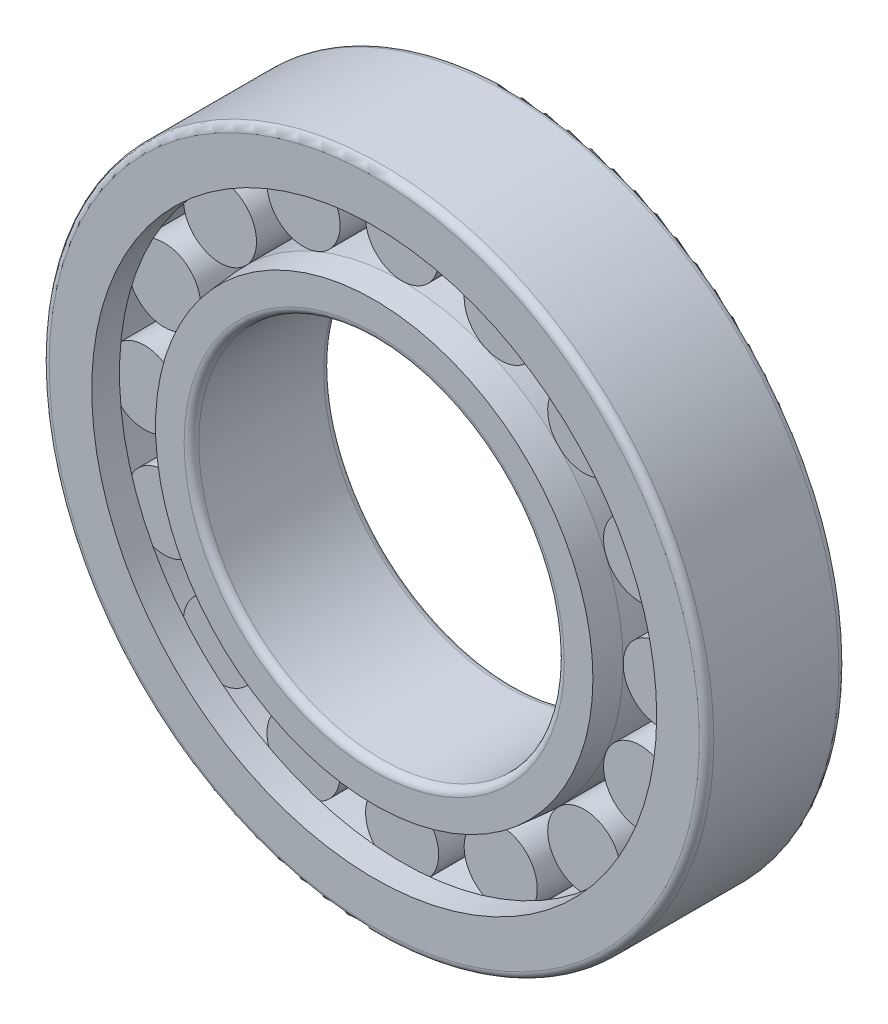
from build123d import *

# Parameters (mm, degrees)
BASESKE_W            = 12.6
BASESKE_H            = 5.5
FILLET1_R            = 1.1
CIRPATTERNBALL_COUNT = 16


with BuildPart() as part:
    # BaseSke → Roller (revolve)
    with BuildSketch(Plane(origin=(0, 0, 0), x_dir=(0, 0, -1), z_dir=(1, 0, 0)), mode=Mode.PRIVATE) as roller_sk:
        with Locations((0, 36)):
            Rectangle(BASESKE_W, BASESKE_H)
    roller = revolve(roller_sk.sketch.rotate(Axis((0, 38.75, 6.3), (0, 0, -1)), 270), axis=Axis((0, 38.75, 6.3), (0, 0, -1)))

    # OuterRaceSke → OuterRace (revolve)
    with BuildSketch(Plane(origin=(0, 0, 0), x_dir=(0, 0, -1), z_dir=(1, 0, 0)), mode=Mode.PRIVATE) as outerrace_sk:
        Polygon((-10.5, 50), (10.5, 50), (10.5, 42.5), (6.325, 42.5), (6.325, 44.23), (-6.325, 44.23), (-6.325, 42.5), (-10.5, 42.5), align=None)
    revolve(outerrace_sk.sketch.rotate(Axis((0, 0, 50.391616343), (0, 0, -1)), 90), axis=Axis((0, 0, 50.391616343), (0, 0, -1)))

    # InnerRaceSke → InnerRace (revolve)
    with BuildSketch(Plane(origin=(0, 0, 0), x_dir=(0, 0, -1), z_dir=(1, 0, 0)), mode=Mode.PRIVATE) as innerrace_sk:
        Polygon((-10.5, 27.5), (10.5, 27.5), (10.5, 35), (6.325, 35), (6.325, 33.27), (-6.325, 33.27), (-6.325, 35), (-10.5, 35), align=None)
    revolve(innerrace_sk.sketch.rotate(Axis((0, 0, 70.862590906), (0, 0, -1)), 90), axis=Axis((0, 0, 70.862590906), (0, 0, -1)))

    # Fillet1
    fillet1_edges = [part.edges().sort_by_distance(p)[0] for p in [
        (-50, 0, 10.5),
        (-50, 0, -10.5),
        (-27.5, 0, -10.5),
        (-27.5, 0, 10.5),
    ]]
    fillet(fillet1_edges, radius=FILLET1_R)

    # NJSke → NJ (revolve, cut)
    with BuildSketch(Plane(origin=(0, 0, 0), x_dir=(0, 0, -1), z_dir=(1, 0, 0)), mode=Mode.PRIVATE) as nj_sk:
        Polygon((10.5, 35), (6.325, 35), (6.325, 33.27), (10.5, 32.90473483), align=None)
    nj = revolve(nj_sk.sketch.rotate(Axis((0, 0, 35.607790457), (0, 0, -1)), 270), axis=Axis((0, 0, 35.607790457), (0, 0, -1)), mode=Mode.SUBTRACT)

    # NU: NJ across plane
    add(nj.mirror(Plane.XY), mode=Mode.SUBTRACT)

    # CirPatternBall: Roller ×16 about axis
    cirpatternball_axis = Axis((0, 0, 0), (0, 0, 1))
    for i in range(1, CIRPATTERNBALL_COUNT):
        add(roller.rotate(cirpatternball_axis, i * 360 / CIRPATTERNBALL_COUNT))


solid = part.part
